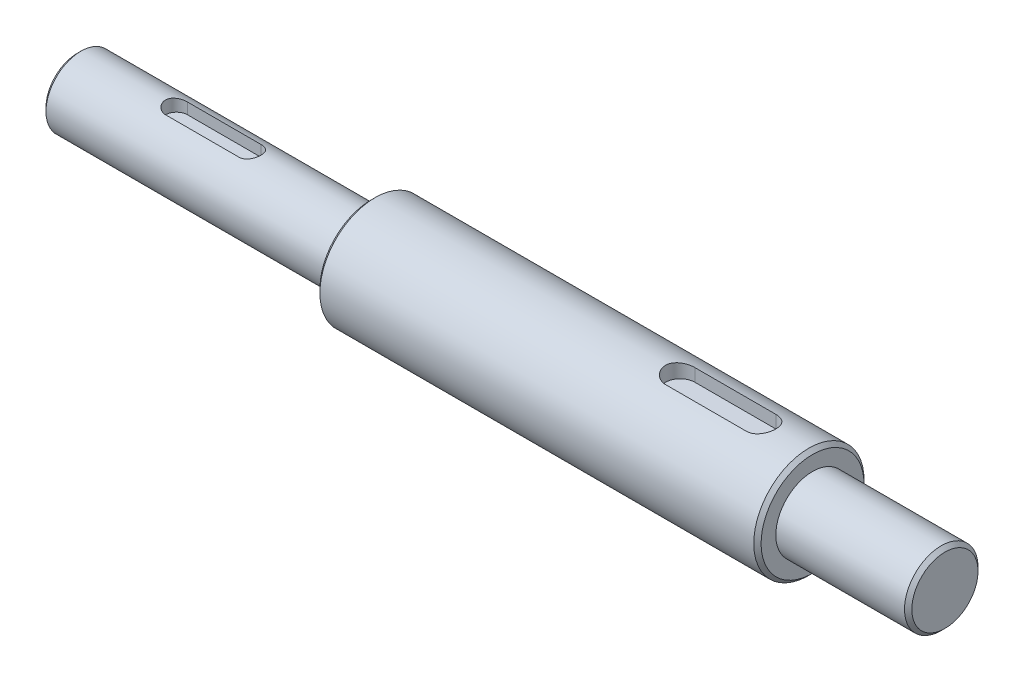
from build123d import *

# Parameters (mm, degrees)
TROU_TARAUD_M8X1_251_D     = 6.8
TROU_TARAUD_M8X1_251_DEPTH = 18.75
TROU_TARAUD_M8X1_251_TIP   = 2.042926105
ENL_V_MAT_EXTRU_2_DEPTH    = 3.5
ENL_V_MAT_EXTRU_21_DEPTH   = 4
ESQUISSE24_OUTSIDE_W       = 79.956
ESQUISSE24_OUTSIDE_H       = 79.956
ESQUISSE24_OUTSIDE_R       = 10
ENL_V_MAT_EXTRU_22_DEPTH   = 36
CHANFREIN1_SIZE            = 1
CHANFREIN2_SIZE            = 1


with BuildPart() as part:
    # Esquisse1 → R_volution1 (revolve)
    with BuildSketch(Plane.XY):
        Polygon((0, 9.5), (80, 9.5), (80, 15), (236, 15), (236, 0), (0, 0), align=None)
    revolve(axis=Axis((236, 0, 0), (-1, 0, 0)))

    # Trou taraud_ M8x1.251
    with Locations(Plane(origin=(0, 0, 0), x_dir=(0, -1, 0), z_dir=(-1, 0, 0))):
        with Locations((0, 0)):
            Hole(TROU_TARAUD_M8X1_251_D / 2, depth=TROU_TARAUD_M8X1_251_DEPTH)
            with Locations((0, 0, -(TROU_TARAUD_M8X1_251_DEPTH + TROU_TARAUD_M8X1_251_TIP / 2))):  # 118° drill point
                Cone(0, TROU_TARAUD_M8X1_251_D / 2, TROU_TARAUD_M8X1_251_TIP, mode=Mode.SUBTRACT)

    # Esquisse11 → Enl_v. mat.-Extru.2 (cut)
    with BuildSketch(Plane(origin=(0, 9.5, 0), x_dir=(0, 0, -1), z_dir=(0, 1, 0))):
        with BuildLine():
            Line((-3, -27), (-3, -47))
            ThreePointArc((-3, -47), (0, -50), (3, -47))
            Line((3, -47), (3, -27))
            ThreePointArc((3, -27), (0, -24), (-3, -27))
        make_face()
    extrude(amount=-ENL_V_MAT_EXTRU_2_DEPTH, mode=Mode.SUBTRACT)

    # Esquisse12 → Enl_v. mat.-Extru.21 (cut)
    with BuildSketch(Plane(origin=(236, 15, 0), x_dir=(0, 0, 1), z_dir=(0, 1, 0))):
        with BuildLine():
            Line((-4, -50), (-4, -72))
            ThreePointArc((-4, -72), (0, -76), (4, -72))
            Line((4, -72), (4, -50))
            ThreePointArc((4, -50), (0, -46), (-4, -50))
        make_face()
    extrude(amount=-ENL_V_MAT_EXTRU_21_DEPTH, mode=Mode.SUBTRACT)

    # Esquisse24 outside → Enl_v. mat.-Extru.22 (cut)
    with BuildSketch(Plane(origin=(236, 0, 0), x_dir=(0, 0, -1), z_dir=(1, 0, 0))):
        Rectangle(ESQUISSE24_OUTSIDE_W, ESQUISSE24_OUTSIDE_H)
        with Locations(Location((0, 0, 0), (0, 0, 90))):
            Circle(ESQUISSE24_OUTSIDE_R, mode=Mode.SUBTRACT)
    extrude(amount=-ENL_V_MAT_EXTRU_22_DEPTH, mode=Mode.SUBTRACT)

    # Chanfrein1
    chanfrein1_edges = [part.edges().sort_by_distance(p)[0] for p in [
        (0, -9.5, 0),
        (236, -10, 0),
    ]]
    chamfer(chanfrein1_edges, length=CHANFREIN1_SIZE)

    # Chanfrein2
    chanfrein2_edges = [part.edges().sort_by_distance(p)[0] for p in [
        (80, -15, 0),
        (200, -15, 0),
    ]]
    chamfer(chanfrein2_edges, length=CHANFREIN2_SIZE)


solid = part.part
